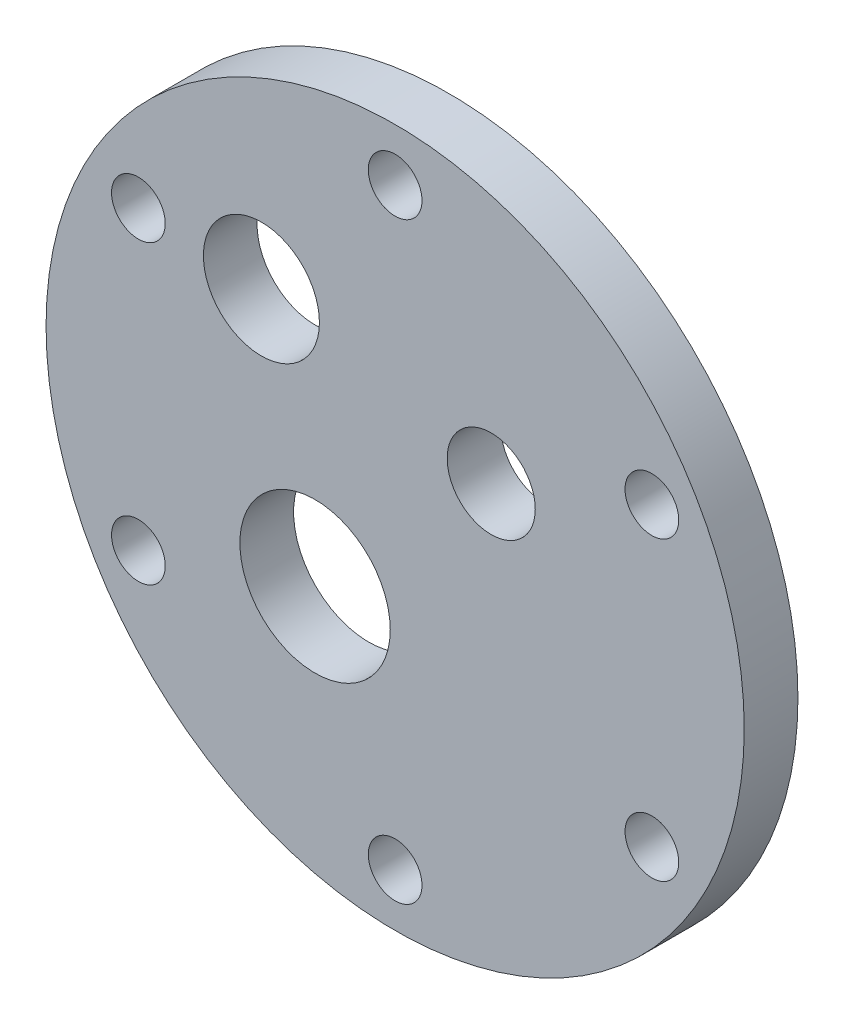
ISO-10303-21;
HEADER;
FILE_DESCRIPTION(('STEP AP214'),'2;1');
FILE_NAME('part.step','',(''),(''),'','','');
FILE_SCHEMA(('AUTOMOTIVE_DESIGN { 1 0 10303 214 1 1 1 1 }'));
ENDSEC;
DATA;
#1=APPLICATION_CONTEXT('core data for automotive mechanical design processes');
#2=APPLICATION_PROTOCOL_DEFINITION('international standard','automotive_design',2000,#1);
#3=PRODUCT_CONTEXT('',#1,'mechanical');
#4=PRODUCT('Part','Part','',(#3));
#5=PRODUCT_RELATED_PRODUCT_CATEGORY('part','',(#4));
#6=PRODUCT_DEFINITION_FORMATION('','',#4);
#7=PRODUCT_DEFINITION_CONTEXT('part definition',#1,'design');
#8=PRODUCT_DEFINITION('design','',#6,#7);
#9=PRODUCT_DEFINITION_SHAPE('','',#8);
#10=(LENGTH_UNIT() NAMED_UNIT(*) SI_UNIT(.MILLI.,.METRE.));
#11=(NAMED_UNIT(*) PLANE_ANGLE_UNIT() SI_UNIT($,.RADIAN.));
#12=(NAMED_UNIT(*) SI_UNIT($,.STERADIAN.) SOLID_ANGLE_UNIT());
#13=UNCERTAINTY_MEASURE_WITH_UNIT(LENGTH_MEASURE(1.E-05),#10,'distance_accuracy_value','');
#14=(GEOMETRIC_REPRESENTATION_CONTEXT(3) GLOBAL_UNCERTAINTY_ASSIGNED_CONTEXT((#13)) GLOBAL_UNIT_ASSIGNED_CONTEXT((#10,
#11,#12)) REPRESENTATION_CONTEXT('',''));
#15=CARTESIAN_POINT('',(0.,0.,0.));
#16=DIRECTION('',(0.,0.,1.));
#17=DIRECTION('',(1.,0.,0.));
#18=AXIS2_PLACEMENT_3D('',#15,#16,#17);
#19=CARTESIAN_POINT('',(0.,0.,6.35));
#20=DIRECTION('',(0.,0.,-1.));
#21=DIRECTION('',(-1.,0.,0.));
#22=AXIS2_PLACEMENT_3D('',#19,#20,#21);
#23=CYLINDRICAL_SURFACE('',#22,41.275);
#24=CARTESIAN_POINT('',(0.,0.,6.35));
#25=DIRECTION('',(0.,0.,1.));
#26=DIRECTION('',(1.,0.,0.));
#27=AXIS2_PLACEMENT_3D('',#24,#25,#26);
#28=CIRCLE('',#27,41.275);
#29=CARTESIAN_POINT('',(41.275,0.,6.35));
#30=VERTEX_POINT('',#29);
#31=EDGE_CURVE('E10',#30,#30,#28,.T.);
#32=ORIENTED_EDGE('',*,*,#31,.F.);
#33=EDGE_LOOP('',(#32));
#34=FACE_BOUND('',#33,.T.);
#35=CARTESIAN_POINT('',(0.,0.,0.));
#36=DIRECTION('',(0.,0.,1.));
#37=DIRECTION('',(1.,0.,0.));
#38=AXIS2_PLACEMENT_3D('',#35,#36,#37);
#39=CIRCLE('',#38,41.275);
#40=CARTESIAN_POINT('',(41.275,0.,0.));
#41=VERTEX_POINT('',#40);
#42=EDGE_CURVE('E41',#41,#41,#39,.T.);
#43=ORIENTED_EDGE('',*,*,#42,.T.);
#44=EDGE_LOOP('',(#43));
#45=FACE_BOUND('',#44,.T.);
#46=ADVANCED_FACE('F38',(#34,#45),#23,.T.);
#47=CARTESIAN_POINT('',(0.,0.,6.35));
#48=DIRECTION('',(0.,0.,1.));
#49=DIRECTION('',(1.,0.,0.));
#50=AXIS2_PLACEMENT_3D('',#47,#48,#49);
#51=PLANE('',#50);
#52=CARTESIAN_POINT('',(11.3592253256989,10.16,6.35));
#53=DIRECTION('',(0.,0.,1.));
#54=DIRECTION('',(1.,0.,0.));
#55=AXIS2_PLACEMENT_3D('',#52,#53,#54);
#56=CIRCLE('',#55,5.207);
#57=CARTESIAN_POINT('',(16.5662253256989,10.16,6.35));
#58=VERTEX_POINT('',#57);
#59=EDGE_CURVE('E98',#58,#58,#56,.T.);
#60=ORIENTED_EDGE('',*,*,#59,.F.);
#61=EDGE_LOOP('',(#60));
#62=FACE_BOUND('',#61,.T.);
#63=CARTESIAN_POINT('',(-9.46844487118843,-10.7595964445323,6.35));
#64=DIRECTION('',(0.,0.,1.));
#65=DIRECTION('',(1.,0.,0.));
#66=AXIS2_PLACEMENT_3D('',#63,#64,#65);
#67=CIRCLE('',#66,8.89);
#68=CARTESIAN_POINT('',(-0.578444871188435,-10.7595964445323,6.35));
#69=VERTEX_POINT('',#68);
#70=EDGE_CURVE('E92',#69,#69,#67,.T.);
#71=ORIENTED_EDGE('',*,*,#70,.F.);
#72=EDGE_LOOP('',(#71));
#73=FACE_BOUND('',#72,.T.);
#74=CARTESIAN_POINT('',(-15.8113724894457,16.51,6.35));
#75=DIRECTION('',(0.,0.,1.));
#76=DIRECTION('',(1.,0.,0.));
#77=AXIS2_PLACEMENT_3D('',#74,#75,#76);
#78=CIRCLE('',#77,6.85800000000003);
#79=CARTESIAN_POINT('',(-8.95337248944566,16.51,6.35));
#80=VERTEX_POINT('',#79);
#81=EDGE_CURVE('E86',#80,#80,#78,.T.);
#82=ORIENTED_EDGE('',*,*,#81,.F.);
#83=EDGE_LOOP('',(#82));
#84=FACE_BOUND('',#83,.T.);
#85=CARTESIAN_POINT('',(30.3559224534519,17.5260000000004,6.35));
#86=DIRECTION('',(0.,0.,1.));
#87=DIRECTION('',(0.50000000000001,-0.866025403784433,0.));
#88=AXIS2_PLACEMENT_3D('',#85,#86,#87);
#89=CIRCLE('',#88,3.175);
#90=CARTESIAN_POINT('',(31.943422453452,14.7763693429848,6.35));
#91=VERTEX_POINT('',#90);
#92=EDGE_CURVE('E65',#91,#91,#89,.T.);
#93=ORIENTED_EDGE('',*,*,#92,.F.);
#94=EDGE_LOOP('',(#93));
#95=FACE_BOUND('',#94,.T.);
#96=CARTESIAN_POINT('',(30.3559224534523,-17.5259999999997,6.35));
#97=DIRECTION('',(0.,0.,1.));
#98=DIRECTION('',(-0.499999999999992,-0.866025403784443,0.));
#99=AXIS2_PLACEMENT_3D('',#96,#97,#98);
#100=CIRCLE('',#99,3.175);
#101=CARTESIAN_POINT('',(28.7684224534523,-20.2756306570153,6.35));
#102=VERTEX_POINT('',#101);
#103=EDGE_CURVE('E72',#102,#102,#100,.T.);
#104=ORIENTED_EDGE('',*,*,#103,.F.);
#105=EDGE_LOOP('',(#104));
#106=FACE_BOUND('',#105,.T.);
#107=CARTESIAN_POINT('',(0.,-35.052,6.35));
#108=DIRECTION('',(0.,0.,1.));
#109=DIRECTION('',(-1.,0.,0.));
#110=AXIS2_PLACEMENT_3D('',#107,#108,#109);
#111=CIRCLE('',#110,3.175);
#112=CARTESIAN_POINT('',(-3.175,-35.052,6.35));
#113=VERTEX_POINT('',#112);
#114=EDGE_CURVE('E78',#113,#113,#111,.T.);
#115=ORIENTED_EDGE('',*,*,#114,.F.);
#116=EDGE_LOOP('',(#115));
#117=FACE_BOUND('',#116,.T.);
#118=CARTESIAN_POINT('',(-30.3559224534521,-17.5260000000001,6.35));
#119=DIRECTION('',(0.,0.,1.));
#120=DIRECTION('',(-0.500000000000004,0.866025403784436,0.));
#121=AXIS2_PLACEMENT_3D('',#118,#119,#120);
#122=CIRCLE('',#121,3.175);
#123=CARTESIAN_POINT('',(-31.9434224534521,-14.7763693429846,6.35));
#124=VERTEX_POINT('',#123);
#125=EDGE_CURVE('E59',#124,#124,#122,.T.);
#126=ORIENTED_EDGE('',*,*,#125,.F.);
#127=EDGE_LOOP('',(#126));
#128=FACE_BOUND('',#127,.T.);
#129=CARTESIAN_POINT('',(-30.3559224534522,17.5259999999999,6.35));
#130=DIRECTION('',(0.,0.,1.));
#131=DIRECTION('',(0.499999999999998,0.86602540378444,0.));
#132=AXIS2_PLACEMENT_3D('',#129,#130,#131);
#133=CIRCLE('',#132,3.175);
#134=CARTESIAN_POINT('',(-28.7684224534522,20.2756306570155,6.35));
#135=VERTEX_POINT('',#134);
#136=EDGE_CURVE('E53',#135,#135,#133,.T.);
#137=ORIENTED_EDGE('',*,*,#136,.F.);
#138=EDGE_LOOP('',(#137));
#139=FACE_BOUND('',#138,.T.);
#140=CARTESIAN_POINT('',(0.,35.052,6.35));
#141=DIRECTION('',(0.,0.,1.));
#142=DIRECTION('',(1.,0.,0.));
#143=AXIS2_PLACEMENT_3D('',#140,#141,#142);
#144=CIRCLE('',#143,3.175);
#145=CARTESIAN_POINT('',(3.175,35.052,6.35));
#146=VERTEX_POINT('',#145);
#147=EDGE_CURVE('E48',#146,#146,#144,.T.);
#148=ORIENTED_EDGE('',*,*,#147,.F.);
#149=EDGE_LOOP('',(#148));
#150=FACE_BOUND('',#149,.T.);
#151=ORIENTED_EDGE('',*,*,#31,.T.);
#152=EDGE_LOOP('',(#151));
#153=FACE_BOUND('',#152,.T.);
#154=ADVANCED_FACE('F114',(#62,#73,#84,#95,#106,#117,#128,#139,#150,#153),#51,.T.);
#155=CARTESIAN_POINT('',(0.,0.,0.));
#156=DIRECTION('',(0.,0.,1.));
#157=DIRECTION('',(1.,0.,0.));
#158=AXIS2_PLACEMENT_3D('',#155,#156,#157);
#159=PLANE('',#158);
#160=CARTESIAN_POINT('',(11.3592253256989,10.16,0.));
#161=DIRECTION('',(0.,0.,1.));
#162=DIRECTION('',(1.,0.,0.));
#163=AXIS2_PLACEMENT_3D('',#160,#161,#162);
#164=CIRCLE('',#163,5.207);
#165=CARTESIAN_POINT('',(16.5662253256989,10.16,0.));
#166=VERTEX_POINT('',#165);
#167=EDGE_CURVE('E95',#166,#166,#164,.T.);
#168=ORIENTED_EDGE('',*,*,#167,.T.);
#169=EDGE_LOOP('',(#168));
#170=FACE_BOUND('',#169,.T.);
#171=CARTESIAN_POINT('',(-9.46844487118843,-10.7595964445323,0.));
#172=DIRECTION('',(0.,0.,1.));
#173=DIRECTION('',(1.,0.,0.));
#174=AXIS2_PLACEMENT_3D('',#171,#172,#173);
#175=CIRCLE('',#174,8.89);
#176=CARTESIAN_POINT('',(-0.578444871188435,-10.7595964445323,0.));
#177=VERTEX_POINT('',#176);
#178=EDGE_CURVE('E89',#177,#177,#175,.T.);
#179=ORIENTED_EDGE('',*,*,#178,.T.);
#180=EDGE_LOOP('',(#179));
#181=FACE_BOUND('',#180,.T.);
#182=CARTESIAN_POINT('',(-15.8113724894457,16.51,0.));
#183=DIRECTION('',(0.,0.,1.));
#184=DIRECTION('',(1.,0.,0.));
#185=AXIS2_PLACEMENT_3D('',#182,#183,#184);
#186=CIRCLE('',#185,6.85800000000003);
#187=CARTESIAN_POINT('',(-8.95337248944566,16.51,0.));
#188=VERTEX_POINT('',#187);
#189=EDGE_CURVE('E66',#188,#188,#186,.T.);
#190=ORIENTED_EDGE('',*,*,#189,.T.);
#191=EDGE_LOOP('',(#190));
#192=FACE_BOUND('',#191,.T.);
#193=CARTESIAN_POINT('',(30.3559224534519,17.5260000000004,0.));
#194=DIRECTION('',(0.,0.,1.));
#195=DIRECTION('',(0.50000000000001,-0.866025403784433,0.));
#196=AXIS2_PLACEMENT_3D('',#193,#194,#195);
#197=CIRCLE('',#196,3.175);
#198=CARTESIAN_POINT('',(31.943422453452,14.7763693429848,0.));
#199=VERTEX_POINT('',#198);
#200=EDGE_CURVE('E62',#199,#199,#197,.T.);
#201=ORIENTED_EDGE('',*,*,#200,.T.);
#202=EDGE_LOOP('',(#201));
#203=FACE_BOUND('',#202,.T.);
#204=CARTESIAN_POINT('',(30.3559224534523,-17.5259999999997,0.));
#205=DIRECTION('',(0.,0.,1.));
#206=DIRECTION('',(-0.499999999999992,-0.866025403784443,0.));
#207=AXIS2_PLACEMENT_3D('',#204,#205,#206);
#208=CIRCLE('',#207,3.175);
#209=CARTESIAN_POINT('',(28.7684224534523,-20.2756306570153,0.));
#210=VERTEX_POINT('',#209);
#211=EDGE_CURVE('E69',#210,#210,#208,.T.);
#212=ORIENTED_EDGE('',*,*,#211,.T.);
#213=EDGE_LOOP('',(#212));
#214=FACE_BOUND('',#213,.T.);
#215=CARTESIAN_POINT('',(0.,-35.052,0.));
#216=DIRECTION('',(0.,0.,1.));
#217=DIRECTION('',(-1.,0.,0.));
#218=AXIS2_PLACEMENT_3D('',#215,#216,#217);
#219=CIRCLE('',#218,3.175);
#220=CARTESIAN_POINT('',(-3.175,-35.052,0.));
#221=VERTEX_POINT('',#220);
#222=EDGE_CURVE('E75',#221,#221,#219,.T.);
#223=ORIENTED_EDGE('',*,*,#222,.T.);
#224=EDGE_LOOP('',(#223));
#225=FACE_BOUND('',#224,.T.);
#226=CARTESIAN_POINT('',(-30.3559224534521,-17.5260000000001,0.));
#227=DIRECTION('',(0.,0.,1.));
#228=DIRECTION('',(-0.500000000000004,0.866025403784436,0.));
#229=AXIS2_PLACEMENT_3D('',#226,#227,#228);
#230=CIRCLE('',#229,3.175);
#231=CARTESIAN_POINT('',(-31.9434224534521,-14.7763693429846,0.));
#232=VERTEX_POINT('',#231);
#233=EDGE_CURVE('E81',#232,#232,#230,.T.);
#234=ORIENTED_EDGE('',*,*,#233,.T.);
#235=EDGE_LOOP('',(#234));
#236=FACE_BOUND('',#235,.T.);
#237=CARTESIAN_POINT('',(-30.3559224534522,17.5259999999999,0.));
#238=DIRECTION('',(0.,0.,1.));
#239=DIRECTION('',(0.499999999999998,0.86602540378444,0.));
#240=AXIS2_PLACEMENT_3D('',#237,#238,#239);
#241=CIRCLE('',#240,3.175);
#242=CARTESIAN_POINT('',(-28.7684224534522,20.2756306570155,0.));
#243=VERTEX_POINT('',#242);
#244=EDGE_CURVE('E56',#243,#243,#241,.T.);
#245=ORIENTED_EDGE('',*,*,#244,.T.);
#246=EDGE_LOOP('',(#245));
#247=FACE_BOUND('',#246,.T.);
#248=CARTESIAN_POINT('',(0.,35.052,0.));
#249=DIRECTION('',(0.,0.,1.));
#250=DIRECTION('',(1.,0.,0.));
#251=AXIS2_PLACEMENT_3D('',#248,#249,#250);
#252=CIRCLE('',#251,3.175);
#253=CARTESIAN_POINT('',(3.175,35.052,0.));
#254=VERTEX_POINT('',#253);
#255=EDGE_CURVE('E50',#254,#254,#252,.T.);
#256=ORIENTED_EDGE('',*,*,#255,.T.);
#257=EDGE_LOOP('',(#256));
#258=FACE_BOUND('',#257,.T.);
#259=ORIENTED_EDGE('',*,*,#42,.F.);
#260=EDGE_LOOP('',(#259));
#261=FACE_BOUND('',#260,.T.);
#262=ADVANCED_FACE('F104',(#170,#181,#192,#203,#214,#225,#236,#247,#258,#261),#159,.F.);
#263=CARTESIAN_POINT('',(0.,35.052,6.35));
#264=DIRECTION('',(0.,0.,-1.));
#265=DIRECTION('',(-1.,0.,0.));
#266=AXIS2_PLACEMENT_3D('',#263,#264,#265);
#267=CYLINDRICAL_SURFACE('',#266,3.175);
#268=ORIENTED_EDGE('',*,*,#147,.T.);
#269=EDGE_LOOP('',(#268));
#270=FACE_BOUND('',#269,.T.);
#271=ORIENTED_EDGE('',*,*,#255,.F.);
#272=EDGE_LOOP('',(#271));
#273=FACE_BOUND('',#272,.T.);
#274=ADVANCED_FACE('F134',(#270,#273),#267,.F.);
#275=CARTESIAN_POINT('',(-30.3559224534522,17.5259999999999,6.35));
#276=DIRECTION('',(0.,0.,-1.));
#277=DIRECTION('',(-1.,0.,0.));
#278=AXIS2_PLACEMENT_3D('',#275,#276,#277);
#279=CYLINDRICAL_SURFACE('',#278,3.175);
#280=ORIENTED_EDGE('',*,*,#136,.T.);
#281=EDGE_LOOP('',(#280));
#282=FACE_BOUND('',#281,.T.);
#283=ORIENTED_EDGE('',*,*,#244,.F.);
#284=EDGE_LOOP('',(#283));
#285=FACE_BOUND('',#284,.T.);
#286=ADVANCED_FACE('F137',(#282,#285),#279,.F.);
#287=CARTESIAN_POINT('',(-30.3559224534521,-17.5260000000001,6.35));
#288=DIRECTION('',(0.,0.,-1.));
#289=DIRECTION('',(-1.,0.,0.));
#290=AXIS2_PLACEMENT_3D('',#287,#288,#289);
#291=CYLINDRICAL_SURFACE('',#290,3.175);
#292=ORIENTED_EDGE('',*,*,#125,.T.);
#293=EDGE_LOOP('',(#292));
#294=FACE_BOUND('',#293,.T.);
#295=ORIENTED_EDGE('',*,*,#233,.F.);
#296=EDGE_LOOP('',(#295));
#297=FACE_BOUND('',#296,.T.);
#298=ADVANCED_FACE('F173',(#294,#297),#291,.F.);
#299=CARTESIAN_POINT('',(0.,-35.052,6.35));
#300=DIRECTION('',(0.,0.,-1.));
#301=DIRECTION('',(-1.,0.,0.));
#302=AXIS2_PLACEMENT_3D('',#299,#300,#301);
#303=CYLINDRICAL_SURFACE('',#302,3.175);
#304=ORIENTED_EDGE('',*,*,#114,.T.);
#305=EDGE_LOOP('',(#304));
#306=FACE_BOUND('',#305,.T.);
#307=ORIENTED_EDGE('',*,*,#222,.F.);
#308=EDGE_LOOP('',(#307));
#309=FACE_BOUND('',#308,.T.);
#310=ADVANCED_FACE('F181',(#306,#309),#303,.F.);
#311=CARTESIAN_POINT('',(30.3559224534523,-17.5259999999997,6.35));
#312=DIRECTION('',(0.,0.,-1.));
#313=DIRECTION('',(-1.,0.,0.));
#314=AXIS2_PLACEMENT_3D('',#311,#312,#313);
#315=CYLINDRICAL_SURFACE('',#314,3.175);
#316=ORIENTED_EDGE('',*,*,#103,.T.);
#317=EDGE_LOOP('',(#316));
#318=FACE_BOUND('',#317,.T.);
#319=ORIENTED_EDGE('',*,*,#211,.F.);
#320=EDGE_LOOP('',(#319));
#321=FACE_BOUND('',#320,.T.);
#322=ADVANCED_FACE('F189',(#318,#321),#315,.F.);
#323=CARTESIAN_POINT('',(30.3559224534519,17.5260000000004,6.35));
#324=DIRECTION('',(0.,0.,-1.));
#325=DIRECTION('',(-1.,0.,0.));
#326=AXIS2_PLACEMENT_3D('',#323,#324,#325);
#327=CYLINDRICAL_SURFACE('',#326,3.175);
#328=ORIENTED_EDGE('',*,*,#92,.T.);
#329=EDGE_LOOP('',(#328));
#330=FACE_BOUND('',#329,.T.);
#331=ORIENTED_EDGE('',*,*,#200,.F.);
#332=EDGE_LOOP('',(#331));
#333=FACE_BOUND('',#332,.T.);
#334=ADVANCED_FACE('F197',(#330,#333),#327,.F.);
#335=CARTESIAN_POINT('',(-15.8113724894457,16.51,0.));
#336=DIRECTION('',(0.,0.,1.));
#337=DIRECTION('',(1.,0.,0.));
#338=AXIS2_PLACEMENT_3D('',#335,#336,#337);
#339=CYLINDRICAL_SURFACE('',#338,6.85800000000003);
#340=ORIENTED_EDGE('',*,*,#189,.F.);
#341=EDGE_LOOP('',(#340));
#342=FACE_BOUND('',#341,.T.);
#343=ORIENTED_EDGE('',*,*,#81,.T.);
#344=EDGE_LOOP('',(#343));
#345=FACE_BOUND('',#344,.T.);
#346=ADVANCED_FACE('F205',(#342,#345),#339,.F.);
#347=CARTESIAN_POINT('',(-9.46844487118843,-10.7595964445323,0.));
#348=DIRECTION('',(0.,0.,1.));
#349=DIRECTION('',(1.,0.,0.));
#350=AXIS2_PLACEMENT_3D('',#347,#348,#349);
#351=CYLINDRICAL_SURFACE('',#350,8.89);
#352=ORIENTED_EDGE('',*,*,#178,.F.);
#353=EDGE_LOOP('',(#352));
#354=FACE_BOUND('',#353,.T.);
#355=ORIENTED_EDGE('',*,*,#70,.T.);
#356=EDGE_LOOP('',(#355));
#357=FACE_BOUND('',#356,.T.);
#358=ADVANCED_FACE('F110',(#354,#357),#351,.F.);
#359=CARTESIAN_POINT('',(11.3592253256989,10.16,0.));
#360=DIRECTION('',(0.,0.,1.));
#361=DIRECTION('',(1.,0.,0.));
#362=AXIS2_PLACEMENT_3D('',#359,#360,#361);
#363=CYLINDRICAL_SURFACE('',#362,5.207);
#364=ORIENTED_EDGE('',*,*,#167,.F.);
#365=EDGE_LOOP('',(#364));
#366=FACE_BOUND('',#365,.T.);
#367=ORIENTED_EDGE('',*,*,#59,.T.);
#368=EDGE_LOOP('',(#367));
#369=FACE_BOUND('',#368,.T.);
#370=ADVANCED_FACE('F107',(#366,#369),#363,.F.);
#371=CLOSED_SHELL('',(#46,#154,#262,#274,#286,#298,#310,#322,#334,#346,#358,#370));
#372=MANIFOLD_SOLID_BREP('B2',#371);
#373=ADVANCED_BREP_SHAPE_REPRESENTATION('',(#18,#372),#14);
#374=SHAPE_DEFINITION_REPRESENTATION(#9,#373);
ENDSEC;
END-ISO-10303-21;
